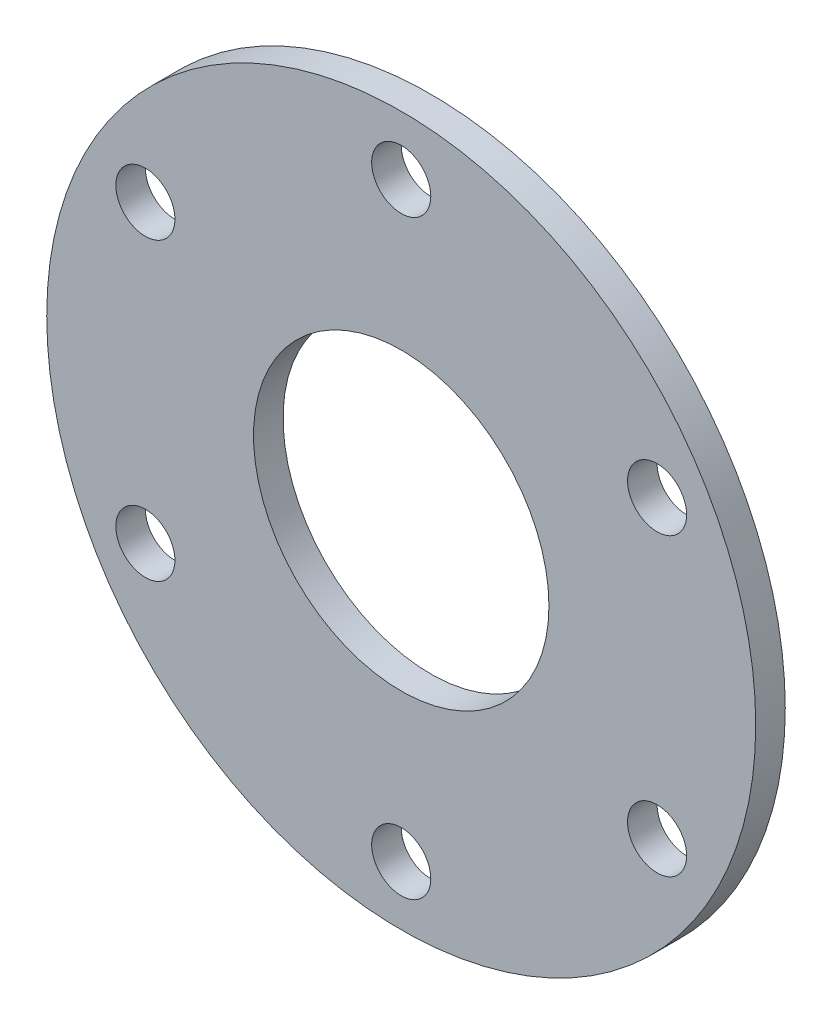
ISO-10303-21;
HEADER;
FILE_DESCRIPTION(('STEP AP214'),'2;1');
FILE_NAME('part.step','',(''),(''),'','','');
FILE_SCHEMA(('AUTOMOTIVE_DESIGN { 1 0 10303 214 1 1 1 1 }'));
ENDSEC;
DATA;
#1=APPLICATION_CONTEXT('core data for automotive mechanical design processes');
#2=APPLICATION_PROTOCOL_DEFINITION('international standard','automotive_design',2000,#1);
#3=PRODUCT_CONTEXT('',#1,'mechanical');
#4=PRODUCT('Part','Part','',(#3));
#5=PRODUCT_RELATED_PRODUCT_CATEGORY('part','',(#4));
#6=PRODUCT_DEFINITION_FORMATION('','',#4);
#7=PRODUCT_DEFINITION_CONTEXT('part definition',#1,'design');
#8=PRODUCT_DEFINITION('design','',#6,#7);
#9=PRODUCT_DEFINITION_SHAPE('','',#8);
#10=(LENGTH_UNIT() NAMED_UNIT(*) SI_UNIT(.MILLI.,.METRE.));
#11=(NAMED_UNIT(*) PLANE_ANGLE_UNIT() SI_UNIT($,.RADIAN.));
#12=(NAMED_UNIT(*) SI_UNIT($,.STERADIAN.) SOLID_ANGLE_UNIT());
#13=UNCERTAINTY_MEASURE_WITH_UNIT(LENGTH_MEASURE(1.E-05),#10,'distance_accuracy_value','');
#14=(GEOMETRIC_REPRESENTATION_CONTEXT(3) GLOBAL_UNCERTAINTY_ASSIGNED_CONTEXT((#13)) GLOBAL_UNIT_ASSIGNED_CONTEXT((#10,
#11,#12)) REPRESENTATION_CONTEXT('',''));
#15=CARTESIAN_POINT('',(0.,0.,0.));
#16=DIRECTION('',(0.,0.,1.));
#17=DIRECTION('',(1.,0.,0.));
#18=AXIS2_PLACEMENT_3D('',#15,#16,#17);
#19=CARTESIAN_POINT('',(0.,0.,5.));
#20=DIRECTION('',(0.,0.,1.));
#21=DIRECTION('',(1.,0.,0.));
#22=AXIS2_PLACEMENT_3D('',#19,#20,#21);
#23=PLANE('',#22);
#24=CARTESIAN_POINT('',(0.,0.,5.));
#25=DIRECTION('',(0.,0.,1.));
#26=DIRECTION('',(1.,0.,0.));
#27=AXIS2_PLACEMENT_3D('',#24,#25,#26);
#28=CIRCLE('',#27,25.);
#29=CARTESIAN_POINT('',(25.,0.,5.));
#30=VERTEX_POINT('',#29);
#31=EDGE_CURVE('E113',#30,#30,#28,.T.);
#32=ORIENTED_EDGE('',*,*,#31,.F.);
#33=EDGE_LOOP('',(#32));
#34=FACE_BOUND('',#33,.T.);
#35=CARTESIAN_POINT('',(0.,-50.,5.));
#36=DIRECTION('',(0.,0.,1.));
#37=DIRECTION('',(1.,0.,0.));
#38=AXIS2_PLACEMENT_3D('',#35,#36,#37);
#39=CIRCLE('',#38,5.00000000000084);
#40=CARTESIAN_POINT('',(5.00000000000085,-50.,5.));
#41=VERTEX_POINT('',#40);
#42=EDGE_CURVE('E87',#41,#41,#39,.T.);
#43=ORIENTED_EDGE('',*,*,#42,.F.);
#44=EDGE_LOOP('',(#43));
#45=FACE_BOUND('',#44,.T.);
#46=CARTESIAN_POINT('',(43.3012701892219,25.,5.));
#47=DIRECTION('',(0.,0.,1.));
#48=DIRECTION('',(1.,0.,0.));
#49=AXIS2_PLACEMENT_3D('',#46,#47,#48);
#50=CIRCLE('',#49,5.00000000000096);
#51=CARTESIAN_POINT('',(48.3012701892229,25.,5.));
#52=VERTEX_POINT('',#51);
#53=EDGE_CURVE('E76',#52,#52,#50,.T.);
#54=ORIENTED_EDGE('',*,*,#53,.F.);
#55=EDGE_LOOP('',(#54));
#56=FACE_BOUND('',#55,.T.);
#57=CARTESIAN_POINT('',(0.,50.,5.));
#58=DIRECTION('',(0.,0.,1.));
#59=DIRECTION('',(1.,0.,0.));
#60=AXIS2_PLACEMENT_3D('',#57,#58,#59);
#61=CIRCLE('',#60,5.);
#62=CARTESIAN_POINT('',(5.,50.,5.));
#63=VERTEX_POINT('',#62);
#64=EDGE_CURVE('E49',#63,#63,#61,.T.);
#65=ORIENTED_EDGE('',*,*,#64,.F.);
#66=EDGE_LOOP('',(#65));
#67=FACE_BOUND('',#66,.T.);
#68=CARTESIAN_POINT('',(0.,0.,5.));
#69=DIRECTION('',(0.,0.,1.));
#70=DIRECTION('',(1.,0.,0.));
#71=AXIS2_PLACEMENT_3D('',#68,#69,#70);
#72=CIRCLE('',#71,60.);
#73=CARTESIAN_POINT('',(60.,0.,5.));
#74=VERTEX_POINT('',#73);
#75=EDGE_CURVE('E11',#74,#74,#72,.T.);
#76=ORIENTED_EDGE('',*,*,#75,.T.);
#77=EDGE_LOOP('',(#76));
#78=FACE_BOUND('',#77,.T.);
#79=CARTESIAN_POINT('',(-43.3012701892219,-25.,5.));
#80=DIRECTION('',(0.,0.,1.));
#81=DIRECTION('',(1.,0.,0.));
#82=AXIS2_PLACEMENT_3D('',#79,#80,#81);
#83=CIRCLE('',#82,5.00000000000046);
#84=CARTESIAN_POINT('',(-38.3012701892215,-25.,5.));
#85=VERTEX_POINT('',#84);
#86=EDGE_CURVE('E65',#85,#85,#83,.T.);
#87=ORIENTED_EDGE('',*,*,#86,.F.);
#88=EDGE_LOOP('',(#87));
#89=FACE_BOUND('',#88,.T.);
#90=CARTESIAN_POINT('',(43.3012701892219,-25.,5.));
#91=DIRECTION('',(0.,0.,1.));
#92=DIRECTION('',(1.,0.,0.));
#93=AXIS2_PLACEMENT_3D('',#90,#91,#92);
#94=CIRCLE('',#93,5.00000000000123);
#95=CARTESIAN_POINT('',(48.3012701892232,-25.,5.));
#96=VERTEX_POINT('',#95);
#97=EDGE_CURVE('E86',#96,#96,#94,.T.);
#98=ORIENTED_EDGE('',*,*,#97,.F.);
#99=EDGE_LOOP('',(#98));
#100=FACE_BOUND('',#99,.T.);
#101=CARTESIAN_POINT('',(-43.301270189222,25.,5.));
#102=DIRECTION('',(0.,0.,1.));
#103=DIRECTION('',(1.,0.,0.));
#104=AXIS2_PLACEMENT_3D('',#101,#102,#103);
#105=CIRCLE('',#104,5.00000000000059);
#106=CARTESIAN_POINT('',(-38.3012701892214,25.,5.));
#107=VERTEX_POINT('',#106);
#108=EDGE_CURVE('E105',#107,#107,#105,.T.);
#109=ORIENTED_EDGE('',*,*,#108,.F.);
#110=EDGE_LOOP('',(#109));
#111=FACE_BOUND('',#110,.T.);
#112=ADVANCED_FACE('F35',(#34,#45,#56,#67,#78,#89,#100,#111),#23,.T.);
#113=CARTESIAN_POINT('',(0.,0.,0.));
#114=DIRECTION('',(0.,0.,1.));
#115=DIRECTION('',(1.,0.,0.));
#116=AXIS2_PLACEMENT_3D('',#113,#114,#115);
#117=PLANE('',#116);
#118=CARTESIAN_POINT('',(0.,0.,0.));
#119=DIRECTION('',(0.,0.,1.));
#120=DIRECTION('',(1.,0.,0.));
#121=AXIS2_PLACEMENT_3D('',#118,#119,#120);
#122=CIRCLE('',#121,25.);
#123=CARTESIAN_POINT('',(25.,0.,0.));
#124=VERTEX_POINT('',#123);
#125=EDGE_CURVE('E39',#124,#124,#122,.T.);
#126=ORIENTED_EDGE('',*,*,#125,.T.);
#127=EDGE_LOOP('',(#126));
#128=FACE_BOUND('',#127,.T.);
#129=CARTESIAN_POINT('',(0.,0.,0.));
#130=DIRECTION('',(0.,0.,1.));
#131=DIRECTION('',(1.,0.,0.));
#132=AXIS2_PLACEMENT_3D('',#129,#130,#131);
#133=CIRCLE('',#132,60.);
#134=CARTESIAN_POINT('',(60.,0.,0.));
#135=VERTEX_POINT('',#134);
#136=EDGE_CURVE('E44',#135,#135,#133,.T.);
#137=ORIENTED_EDGE('',*,*,#136,.F.);
#138=EDGE_LOOP('',(#137));
#139=FACE_BOUND('',#138,.T.);
#140=CARTESIAN_POINT('',(0.,50.,0.));
#141=DIRECTION('',(0.,0.,1.));
#142=DIRECTION('',(1.,0.,0.));
#143=AXIS2_PLACEMENT_3D('',#140,#141,#142);
#144=CIRCLE('',#143,5.);
#145=CARTESIAN_POINT('',(5.,50.,0.));
#146=VERTEX_POINT('',#145);
#147=EDGE_CURVE('E52',#146,#146,#144,.T.);
#148=ORIENTED_EDGE('',*,*,#147,.T.);
#149=EDGE_LOOP('',(#148));
#150=FACE_BOUND('',#149,.T.);
#151=CARTESIAN_POINT('',(-43.3012701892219,-25.,0.));
#152=DIRECTION('',(0.,0.,1.));
#153=DIRECTION('',(1.,0.,0.));
#154=AXIS2_PLACEMENT_3D('',#151,#152,#153);
#155=CIRCLE('',#154,5.00000000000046);
#156=CARTESIAN_POINT('',(-38.3012701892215,-25.,0.));
#157=VERTEX_POINT('',#156);
#158=EDGE_CURVE('E70',#157,#157,#155,.T.);
#159=ORIENTED_EDGE('',*,*,#158,.T.);
#160=EDGE_LOOP('',(#159));
#161=FACE_BOUND('',#160,.T.);
#162=CARTESIAN_POINT('',(43.3012701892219,25.,0.));
#163=DIRECTION('',(0.,0.,1.));
#164=DIRECTION('',(1.,0.,0.));
#165=AXIS2_PLACEMENT_3D('',#162,#163,#164);
#166=CIRCLE('',#165,5.00000000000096);
#167=CARTESIAN_POINT('',(48.3012701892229,25.,0.));
#168=VERTEX_POINT('',#167);
#169=EDGE_CURVE('E71',#168,#168,#166,.T.);
#170=ORIENTED_EDGE('',*,*,#169,.T.);
#171=EDGE_LOOP('',(#170));
#172=FACE_BOUND('',#171,.T.);
#173=CARTESIAN_POINT('',(43.3012701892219,-25.,0.));
#174=DIRECTION('',(0.,0.,1.));
#175=DIRECTION('',(1.,0.,0.));
#176=AXIS2_PLACEMENT_3D('',#173,#174,#175);
#177=CIRCLE('',#176,5.00000000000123);
#178=CARTESIAN_POINT('',(48.3012701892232,-25.,0.));
#179=VERTEX_POINT('',#178);
#180=EDGE_CURVE('E83',#179,#179,#177,.T.);
#181=ORIENTED_EDGE('',*,*,#180,.T.);
#182=EDGE_LOOP('',(#181));
#183=FACE_BOUND('',#182,.T.);
#184=CARTESIAN_POINT('',(0.,-50.,0.));
#185=DIRECTION('',(0.,0.,1.));
#186=DIRECTION('',(1.,0.,0.));
#187=AXIS2_PLACEMENT_3D('',#184,#185,#186);
#188=CIRCLE('',#187,5.00000000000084);
#189=CARTESIAN_POINT('',(5.00000000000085,-50.,0.));
#190=VERTEX_POINT('',#189);
#191=EDGE_CURVE('E100',#190,#190,#188,.T.);
#192=ORIENTED_EDGE('',*,*,#191,.T.);
#193=EDGE_LOOP('',(#192));
#194=FACE_BOUND('',#193,.T.);
#195=CARTESIAN_POINT('',(-43.301270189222,25.,0.));
#196=DIRECTION('',(0.,0.,1.));
#197=DIRECTION('',(1.,0.,0.));
#198=AXIS2_PLACEMENT_3D('',#195,#196,#197);
#199=CIRCLE('',#198,5.00000000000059);
#200=CARTESIAN_POINT('',(-38.3012701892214,25.,0.));
#201=VERTEX_POINT('',#200);
#202=EDGE_CURVE('E101',#201,#201,#199,.T.);
#203=ORIENTED_EDGE('',*,*,#202,.T.);
#204=EDGE_LOOP('',(#203));
#205=FACE_BOUND('',#204,.T.);
#206=ADVANCED_FACE('F121',(#128,#139,#150,#161,#172,#183,#194,#205),#117,.F.);
#207=CARTESIAN_POINT('',(0.,0.,5.));
#208=DIRECTION('',(0.,0.,-1.));
#209=DIRECTION('',(-1.,0.,0.));
#210=AXIS2_PLACEMENT_3D('',#207,#208,#209);
#211=CYLINDRICAL_SURFACE('',#210,60.);
#212=ORIENTED_EDGE('',*,*,#75,.F.);
#213=EDGE_LOOP('',(#212));
#214=FACE_BOUND('',#213,.T.);
#215=ORIENTED_EDGE('',*,*,#136,.T.);
#216=EDGE_LOOP('',(#215));
#217=FACE_BOUND('',#216,.T.);
#218=ADVANCED_FACE('F37',(#214,#217),#211,.T.);
#219=CARTESIAN_POINT('',(0.,50.,5.));
#220=DIRECTION('',(0.,0.,-1.));
#221=DIRECTION('',(-1.,0.,0.));
#222=AXIS2_PLACEMENT_3D('',#219,#220,#221);
#223=CYLINDRICAL_SURFACE('',#222,5.);
#224=ORIENTED_EDGE('',*,*,#64,.T.);
#225=EDGE_LOOP('',(#224));
#226=FACE_BOUND('',#225,.T.);
#227=ORIENTED_EDGE('',*,*,#147,.F.);
#228=EDGE_LOOP('',(#227));
#229=FACE_BOUND('',#228,.T.);
#230=ADVANCED_FACE('F141',(#226,#229),#223,.F.);
#231=CARTESIAN_POINT('',(-43.3012701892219,-25.,5.));
#232=DIRECTION('',(0.,0.,-1.));
#233=DIRECTION('',(-1.,0.,0.));
#234=AXIS2_PLACEMENT_3D('',#231,#232,#233);
#235=CYLINDRICAL_SURFACE('',#234,5.00000000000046);
#236=ORIENTED_EDGE('',*,*,#86,.T.);
#237=EDGE_LOOP('',(#236));
#238=FACE_BOUND('',#237,.T.);
#239=ORIENTED_EDGE('',*,*,#158,.F.);
#240=EDGE_LOOP('',(#239));
#241=FACE_BOUND('',#240,.T.);
#242=ADVANCED_FACE('F144',(#238,#241),#235,.F.);
#243=CARTESIAN_POINT('',(43.3012701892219,25.,5.));
#244=DIRECTION('',(0.,0.,-1.));
#245=DIRECTION('',(-1.,0.,0.));
#246=AXIS2_PLACEMENT_3D('',#243,#244,#245);
#247=CYLINDRICAL_SURFACE('',#246,5.00000000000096);
#248=ORIENTED_EDGE('',*,*,#53,.T.);
#249=EDGE_LOOP('',(#248));
#250=FACE_BOUND('',#249,.T.);
#251=ORIENTED_EDGE('',*,*,#169,.F.);
#252=EDGE_LOOP('',(#251));
#253=FACE_BOUND('',#252,.T.);
#254=ADVANCED_FACE('F148',(#250,#253),#247,.F.);
#255=CARTESIAN_POINT('',(43.3012701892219,-25.,5.));
#256=DIRECTION('',(0.,0.,-1.));
#257=DIRECTION('',(-1.,0.,0.));
#258=AXIS2_PLACEMENT_3D('',#255,#256,#257);
#259=CYLINDRICAL_SURFACE('',#258,5.00000000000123);
#260=ORIENTED_EDGE('',*,*,#97,.T.);
#261=EDGE_LOOP('',(#260));
#262=FACE_BOUND('',#261,.T.);
#263=ORIENTED_EDGE('',*,*,#180,.F.);
#264=EDGE_LOOP('',(#263));
#265=FACE_BOUND('',#264,.T.);
#266=ADVANCED_FACE('F152',(#262,#265),#259,.F.);
#267=CARTESIAN_POINT('',(0.,-50.,5.));
#268=DIRECTION('',(0.,0.,-1.));
#269=DIRECTION('',(-1.,0.,0.));
#270=AXIS2_PLACEMENT_3D('',#267,#268,#269);
#271=CYLINDRICAL_SURFACE('',#270,5.00000000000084);
#272=ORIENTED_EDGE('',*,*,#42,.T.);
#273=EDGE_LOOP('',(#272));
#274=FACE_BOUND('',#273,.T.);
#275=ORIENTED_EDGE('',*,*,#191,.F.);
#276=EDGE_LOOP('',(#275));
#277=FACE_BOUND('',#276,.T.);
#278=ADVANCED_FACE('F131',(#274,#277),#271,.F.);
#279=CARTESIAN_POINT('',(-43.301270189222,25.,5.));
#280=DIRECTION('',(0.,0.,-1.));
#281=DIRECTION('',(-1.,0.,0.));
#282=AXIS2_PLACEMENT_3D('',#279,#280,#281);
#283=CYLINDRICAL_SURFACE('',#282,5.00000000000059);
#284=ORIENTED_EDGE('',*,*,#108,.T.);
#285=EDGE_LOOP('',(#284));
#286=FACE_BOUND('',#285,.T.);
#287=ORIENTED_EDGE('',*,*,#202,.F.);
#288=EDGE_LOOP('',(#287));
#289=FACE_BOUND('',#288,.T.);
#290=ADVANCED_FACE('F126',(#286,#289),#283,.F.);
#291=CARTESIAN_POINT('',(0.,0.,-5.));
#292=DIRECTION('',(0.,0.,1.));
#293=DIRECTION('',(1.,0.,0.));
#294=AXIS2_PLACEMENT_3D('',#291,#292,#293);
#295=CYLINDRICAL_SURFACE('',#294,25.);
#296=ORIENTED_EDGE('',*,*,#31,.T.);
#297=EDGE_LOOP('',(#296));
#298=FACE_BOUND('',#297,.T.);
#299=ORIENTED_EDGE('',*,*,#125,.F.);
#300=EDGE_LOOP('',(#299));
#301=FACE_BOUND('',#300,.T.);
#302=ADVANCED_FACE('F124',(#298,#301),#295,.F.);
#303=CLOSED_SHELL('',(#112,#206,#218,#230,#242,#254,#266,#278,#290,#302));
#304=MANIFOLD_SOLID_BREP('B2',#303);
#305=ADVANCED_BREP_SHAPE_REPRESENTATION('',(#18,#304),#14);
#306=SHAPE_DEFINITION_REPRESENTATION(#9,#305);
ENDSEC;
END-ISO-10303-21;
